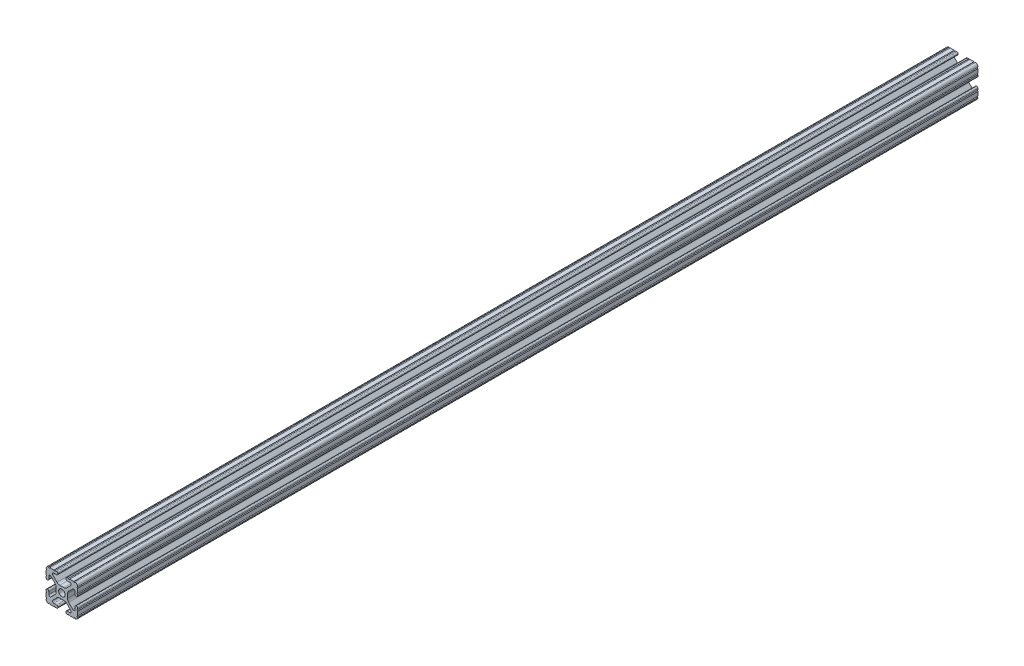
from build123d import *

# Parameters (mm, degrees)
SKETCH1_R           = 2.6035
BOSS_EXTRUDE1_DEPTH = 721.1568


with BuildPart() as part:
    # Sketch1 → Boss-Extrude1 (new body)
    with BuildSketch(Plane.XY):
        with BuildLine():
            Line((-7.179650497, -8.645192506), (-3.952270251, -5.423690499))
            ThreePointArc((-3.952270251, -5.423690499), (-2.922936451, -4.736929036), (-1.709253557, -4.4958))
            Line((-1.709253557, -4.4958), (1.709253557, -4.4958))
            ThreePointArc((1.709253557, -4.4958), (2.922936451, -4.736929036), (3.952270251, -5.423690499))
            Line((3.952270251, -5.423690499), (7.179650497, -8.645192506))
            ThreePointArc((7.179650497, -8.645192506), (7.41473083, -9.822813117), (6.416408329, -10.4902))
            Line((6.416408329, -10.4902), (4.287512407, -10.4902))
            ThreePointArc((4.287512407, -10.4902), (3.54574862, -10.79744862), (3.2385, -11.539212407))
            Line((3.2385, -11.539212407), (3.2385, -11.650987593))
            ThreePointArc((3.2385, -11.650987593), (3.54574862, -12.39275138), (4.287512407, -12.7))
            Line((4.287512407, -12.7), (5.317126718, -12.7))
            ThreePointArc((5.317126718, -12.7), (5.825126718, -12.192), (6.333126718, -12.7))
            Line((6.333126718, -12.7), (9.550443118, -12.7))
            ThreePointArc((9.550443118, -12.7), (10.058366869, -12.192000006), (10.566443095, -12.699847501))
            ThreePointArc((10.566443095, -12.699847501), (12.082537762, -12.08250727), (12.699846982, -10.566399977))
            ThreePointArc((12.699846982, -10.566399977), (12.192000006, -10.058323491), (12.7, -9.5504))
            Line((12.7, -9.5504), (12.7, -6.3330836))
            ThreePointArc((12.7, -6.3330836), (12.192, -5.8250836), (12.7, -5.3170836))
            Line((12.7, -5.3170836), (12.7, -4.287469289))
            ThreePointArc((12.7, -4.287469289), (12.39275138, -3.545705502), (11.650987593, -3.238456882))
            Line((11.650987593, -3.238456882), (11.539212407, -3.238456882))
            ThreePointArc((11.539212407, -3.238456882), (10.79744862, -3.545705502), (10.4902, -4.287469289))
            Line((10.4902, -4.287469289), (10.4902, -6.402089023))
            ThreePointArc((10.4902, -6.402089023), (9.856505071, -7.351067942), (8.737131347, -7.129408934))
            Line((8.737131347, -7.129408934), (5.441005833, -3.840816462))
            ThreePointArc((5.441005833, -3.840816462), (4.750877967, -2.809883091), (4.5085, -1.593185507))
            Line((4.5085, -1.593185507), (4.5085, 1.593185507))
            ThreePointArc((4.5085, 1.593185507), (4.750877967, 2.809883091), (5.441005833, 3.840816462))
            Line((5.441005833, 3.840816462), (8.737131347, 7.129408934))
            ThreePointArc((8.737131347, 7.129408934), (9.856505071, 7.351067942), (10.4902, 6.402089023))
            Line((10.4902, 6.402089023), (10.4902, 4.287469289))
            ThreePointArc((10.4902, 4.287469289), (10.79744862, 3.545705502), (11.539212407, 3.238456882))
            Line((11.539212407, 3.238456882), (11.650987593, 3.238456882))
            ThreePointArc((11.650987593, 3.238456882), (12.39275138, 3.545705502), (12.7, 4.287469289))
            Line((12.7, 4.287469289), (12.7, 5.3170836))
            ThreePointArc((12.7, 5.3170836), (12.192, 5.8250836), (12.7, 6.3330836))
            Line((12.7, 6.3330836), (12.7, 9.5504))
            ThreePointArc((12.7, 9.5504), (12.192000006, 10.058323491), (12.699846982, 10.566399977))
            ThreePointArc((12.699846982, 10.566399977), (12.082537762, 12.08250727), (10.566443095, 12.699847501))
            ThreePointArc((10.566443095, 12.699847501), (10.058366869, 12.192000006), (9.550443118, 12.7))
            Line((9.550443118, 12.7), (6.333126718, 12.7))
            ThreePointArc((6.333126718, 12.7), (5.825126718, 12.192), (5.317126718, 12.7))
            Line((5.317126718, 12.7), (4.287512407, 12.7))
            ThreePointArc((4.287512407, 12.7), (3.54574862, 12.39275138), (3.2385, 11.650987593))
            Line((3.2385, 11.650987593), (3.2385, 11.539212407))
            ThreePointArc((3.2385, 11.539212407), (3.54574862, 10.79744862), (4.287512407, 10.4902))
            Line((4.287512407, 10.4902), (6.476788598, 10.4902))
            ThreePointArc((6.476788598, 10.4902), (7.432222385, 9.85140422), (7.207036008, 8.724370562))
            Line((7.207036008, 8.724370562), (3.898272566, 5.423169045))
            ThreePointArc((3.898272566, 5.423169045), (2.869120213, 4.736787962), (1.655778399, 4.4958))
            Line((1.655778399, 4.4958), (-1.655778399, 4.4958))
            ThreePointArc((-1.655778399, 4.4958), (-2.869120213, 4.736787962), (-3.898272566, 5.423169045))
            Line((-3.898272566, 5.423169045), (-7.207036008, 8.724370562))
            ThreePointArc((-7.207036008, 8.724370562), (-7.432222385, 9.85140422), (-6.476788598, 10.4902))
            Line((-6.476788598, 10.4902), (-4.287512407, 10.4902))
            ThreePointArc((-4.287512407, 10.4902), (-3.54574862, 10.79744862), (-3.2385, 11.539212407))
            Line((-3.2385, 11.539212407), (-3.2385, 11.650987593))
            ThreePointArc((-3.2385, 11.650987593), (-3.54574862, 12.39275138), (-4.287512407, 12.7))
            Line((-4.287512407, 12.7), (-5.317126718, 12.7))
            ThreePointArc((-5.317126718, 12.7), (-5.825126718, 12.192), (-6.333126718, 12.7))
            Line((-6.333126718, 12.7), (-9.550443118, 12.7))
            ThreePointArc((-9.550443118, 12.7), (-10.058366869, 12.192000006), (-10.566443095, 12.699847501))
            ThreePointArc((-10.566443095, 12.699847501), (-12.082537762, 12.08250727), (-12.699846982, 10.566399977))
            ThreePointArc((-12.699846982, 10.566399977), (-12.192000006, 10.058323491), (-12.7, 9.5504))
            Line((-12.7, 9.5504), (-12.7, 6.3330836))
            ThreePointArc((-12.7, 6.3330836), (-12.192, 5.8250836), (-12.7, 5.3170836))
            Line((-12.7, 5.3170836), (-12.7, 4.287469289))
            ThreePointArc((-12.7, 4.287469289), (-12.39275138, 3.545705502), (-11.650987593, 3.238456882))
            Line((-11.650987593, 3.238456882), (-11.539212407, 3.238456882))
            ThreePointArc((-11.539212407, 3.238456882), (-10.79744862, 3.545705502), (-10.4902, 4.287469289))
            Line((-10.4902, 4.287469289), (-10.4902, 6.402089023))
            ThreePointArc((-10.4902, 6.402089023), (-9.856505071, 7.351067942), (-8.737131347, 7.129408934))
            Line((-8.737131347, 7.129408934), (-5.441005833, 3.840816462))
            ThreePointArc((-5.441005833, 3.840816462), (-4.750877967, 2.809883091), (-4.5085, 1.593185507))
            Line((-4.5085, 1.593185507), (-4.5085, -1.593185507))
            ThreePointArc((-4.5085, -1.593185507), (-4.750877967, -2.809883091), (-5.441005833, -3.840816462))
            Line((-5.441005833, -3.840816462), (-8.737131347, -7.129408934))
            ThreePointArc((-8.737131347, -7.129408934), (-9.856505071, -7.351067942), (-10.4902, -6.402089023))
            Line((-10.4902, -6.402089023), (-10.4902, -4.287469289))
            ThreePointArc((-10.4902, -4.287469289), (-10.79744862, -3.545705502), (-11.539212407, -3.238456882))
            Line((-11.539212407, -3.238456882), (-11.650987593, -3.238456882))
            ThreePointArc((-11.650987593, -3.238456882), (-12.39275138, -3.545705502), (-12.7, -4.287469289))
            Line((-12.7, -4.287469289), (-12.7, -5.3170836))
            ThreePointArc((-12.7, -5.3170836), (-12.192, -5.8250836), (-12.7, -6.3330836))
            Line((-12.7, -6.3330836), (-12.7, -9.5504))
            ThreePointArc((-12.7, -9.5504), (-12.192000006, -10.058323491), (-12.699846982, -10.566399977))
            ThreePointArc((-12.699846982, -10.566399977), (-12.082537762, -12.08250727), (-10.566443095, -12.699847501))
            ThreePointArc((-10.566443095, -12.699847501), (-10.058366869, -12.192000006), (-9.550443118, -12.7))
            Line((-9.550443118, -12.7), (-6.333126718, -12.7))
            ThreePointArc((-6.333126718, -12.7), (-5.825126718, -12.192), (-5.317126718, -12.7))
            Line((-5.317126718, -12.7), (-4.287512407, -12.7))
            ThreePointArc((-4.287512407, -12.7), (-3.54574862, -12.39275138), (-3.2385, -11.650987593))
            Line((-3.2385, -11.650987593), (-3.2385, -11.539212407))
            ThreePointArc((-3.2385, -11.539212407), (-3.54574862, -10.79744862), (-4.287512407, -10.4902))
            Line((-4.287512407, -10.4902), (-6.416408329, -10.4902))
            ThreePointArc((-6.416408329, -10.4902), (-7.41473083, -9.822813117), (-7.179650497, -8.645192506))
        make_face()
        with Locations(Location((0, 0, 0), (0, 0, 270))):
            Circle(SKETCH1_R, mode=Mode.SUBTRACT)
    extrude(amount=BOSS_EXTRUDE1_DEPTH)


solid = part.part
